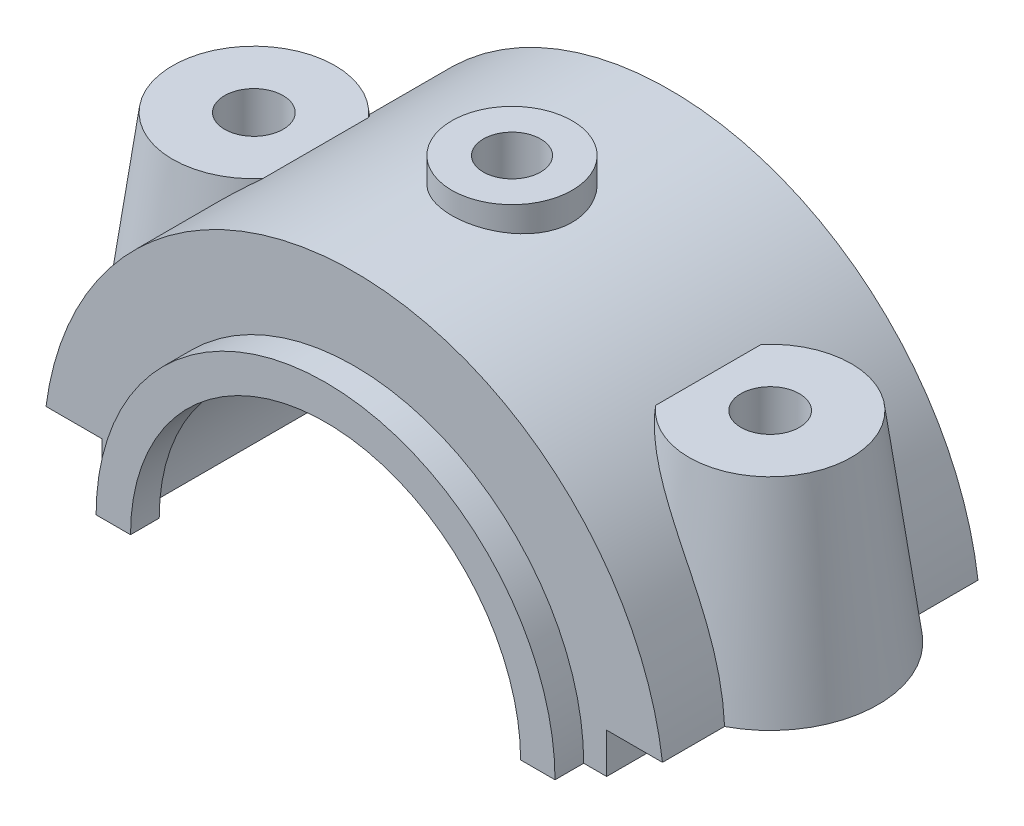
from build123d import *

# Parameters (mm, degrees)
EXTRUDE_1_DEPTH      = 27.5
EXTRUDE_2_DEPTH      = 32.5
EXTRUDE_2_DEPTH_BACK = 32.5
HOLE_WIZARD_M12_1_D  = 10.2
CUT_EXTRUDE_START    = -27.5
CUT_EXTRUDE_2_DEPTH  = 55
EXTRUDE_3_REACH      = 94.16
EXTRUDE_3_END_RADIUS = 54.187370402
SKETCH_8_R           = 10.5
SKETCH_9_W           = 3
SKETCH_9_H           = 8
SKETCH_10_R          = 5
CUT_EXTRUDE_3_DEPTH  = 14


with BuildPart() as part:
    # Sketch 1 → Extrude 1 (new, symmetric)
    with BuildSketch(Plane.XY):
        with BuildLine():
            Line((-53.733333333, 77), (-44, 77))
            Line((-44, 77), (-44, 70))
            Line((-44, 70), (-40, 70))
            ThreePointArc((-40, 70), (-28.284271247, 98.284271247), (0, 110))
            Line((0, 110), (0, 124.187370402))
            ThreePointArc((0, 124.187370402), (-35.755835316, 110.715983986), (-53.733333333, 77))
        make_face()
    extrude(amount=EXTRUDE_1_DEPTH, both=True)

    # Sketch 2 → Extrude 2 (add, two sides: drawn at the far end of the back side and taken through both)
    with BuildSketch(Plane.XY.offset(-EXTRUDE_2_DEPTH_BACK)):
        with BuildLine():
            Line((-40, 70), (-34, 70))
            ThreePointArc((-34, 70), (-24.04163056, 94.04163056), (0, 104))
            Line((0, 104), (0, 110))
            ThreePointArc((0, 110), (-28.284271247, 98.284271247), (-40, 70))
        make_face()
    extrude(amount=EXTRUDE_2_DEPTH + EXTRUDE_2_DEPTH_BACK)

    # Sketch 4 → Revolve 2 (revolve)
    with BuildSketch(Plane.XY):
        Polygon((-45, 77), (-63.821830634, 77), (-59.155163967, 112), (-45, 112), align=None)
    revolve(axis=Axis((-45, 4, 0), (0, 1, 0)))

    # Hole Wizard M12 _1 (through all)
    with Locations(Plane(origin=(0, 112, 0), x_dir=(-1, 0, 0), z_dir=(0, 1, 0))):
        with Locations((45, 0)):
            Hole(HOLE_WIZARD_M12_1_D / 2)

    # Sketch 7 → Cut-Extrude 2 (cut)
    with BuildSketch(Plane.XY.offset(CUT_EXTRUDE_START)):
        with BuildLine():
            Line((0, 70), (-37, 70))
            ThreePointArc((-37, 70), (-26.162950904, 96.162950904), (0, 107))
            Line((0, 107), (0, 70))
        make_face()
    extrude(amount=CUT_EXTRUDE_2_DEPTH, mode=Mode.SUBTRACT)

    # Mirror 1: part across plane


with BuildPart() as part_1:
    add(part.part)
    add(part.part.mirror(Plane(origin=(0, 124.187370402, 27.5), x_dir=(0, 0, 1), z_dir=(-1, 0, 0))))

    # Extrude 3: up to this cylinder (the profile starts outside it)
    extrude_3_end = Plane(origin=(0, 70, 0), z_dir=(0, 0, -1)) * Cylinder(EXTRUDE_3_END_RADIUS, 297.694740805, mode=Mode.PRIVATE)
    # Sketch 8 → Extrude 3 (add, up to the surface)
    with BuildSketch(Plane(origin=(0, 128, 0), x_dir=(-1, 0, 0), z_dir=(0, 1, 0)), mode=Mode.PRIVATE) as extrude_3_sk1:
        with Locations(Location((0, 0, 0), (0, 0, 90))):
            Circle(SKETCH_8_R)
    extrude_3_tool1 = extrude(extrude_3_sk1.sketch, amount=-EXTRUDE_3_REACH, mode=Mode.PRIVATE) - extrude_3_end
    add(extrude_3_tool1.solids().sort_by_distance((0, 128, 0))[0])

    # Sketch 9 → Cut-Revolve 2 (revolve, cut)
    with BuildSketch(Plane.XY, mode=Mode.PRIVATE) as cut_revolve_2_sk:
        with Locations((-1.5, 110)):
            Rectangle(SKETCH_9_W, SKETCH_9_H)
    revolve(cut_revolve_2_sk.sketch.rotate(Axis((0, 110, 0), (0, 1, 0)), 180), axis=Axis((0, 110, 0), (0, 1, 0)), mode=Mode.SUBTRACT)

    # Sketch 10 → Cut-Extrude 3 (cut)
    with BuildSketch(Plane(origin=(0, 128, 0), x_dir=(1, 0, 0), z_dir=(0, 1, 0))):
        with Locations(Location((0, 0, 0), (0, 0, 270))):
            Circle(SKETCH_10_R)
    extrude(amount=-CUT_EXTRUDE_3_DEPTH, mode=Mode.SUBTRACT)


solid = part_1.part
